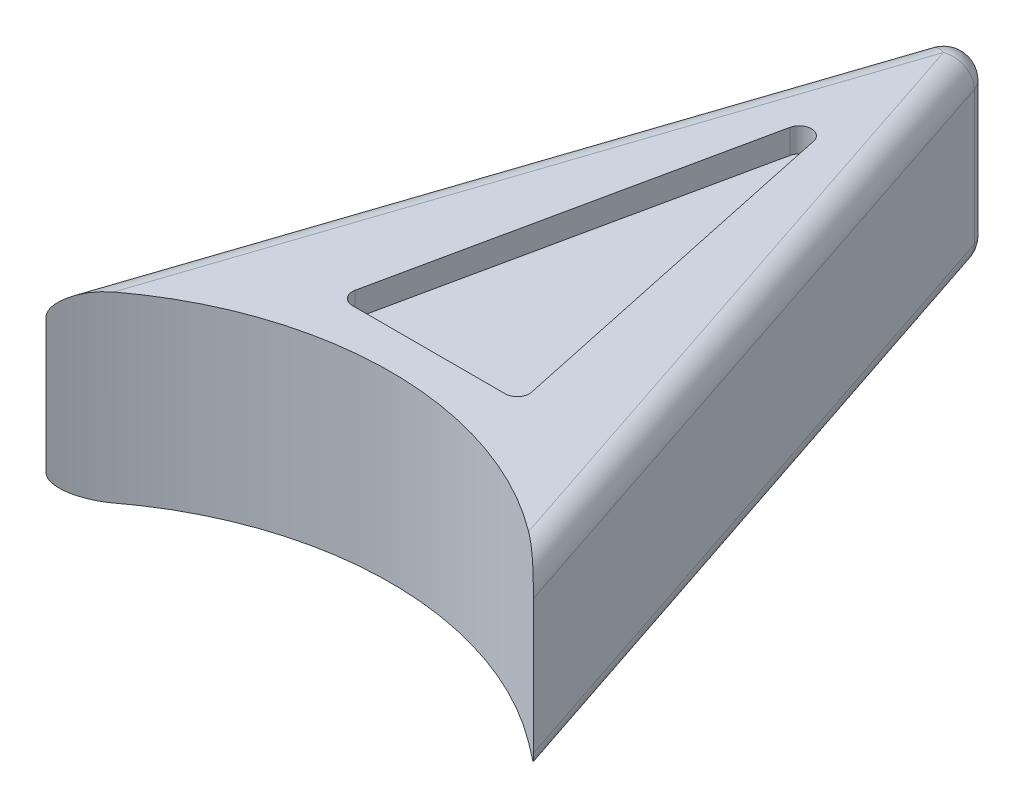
from build123d import *

# Parameters (mm, degrees)
BOSS_EXTRUDE1_DEPTH = 19.05
FILLET3_R           = 2.54
FILLET4_R           = 2.54
CUT_EXTRUDE1_DEPTH  = 2.54
FILLET5_R           = 1.27


with BuildPart() as part:
    # Sketch1 → Boss-Extrude1 (new body)
    with BuildSketch(Plane(origin=(0, 0, 0), x_dir=(1, 0, 0), z_dir=(0, 1, 0))):
        with BuildLine():
            Line((0, 76.2), (-25.4, 0))
            ThreePointArc((-25.4, 0), (0, 10.521024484), (25.4, 0))
            Line((25.4, 0), (0, 76.2))
        make_face()
    extrude(amount=BOSS_EXTRUDE1_DEPTH)

    # Fillet3
    fillet3_edges = [part.edges().sort_by_distance(p)[0] for p in [
        (0, 9.525, -76.2),
    ]]
    fillet(fillet3_edges, radius=FILLET3_R)

    # Fillet4
    fillet4_edges = [part.edges().sort_by_distance(p)[0] for p in [
        (-13.904827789, 0, -34.485516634),
        (-13.904827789, 19.05, -34.485516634),
        (0, 0, -70.707814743),
        (0, 19.05, -70.707814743),
        (13.904827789, 0, -34.485516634),
        (13.904827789, 19.05, -34.485516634),
    ]]
    fillet(fillet4_edges, radius=FILLET4_R)

    # Sketch2 → Cut-Extrude1 (cut)
    with BuildSketch(Plane(origin=(0, 19.05, 0), x_dir=(1, 0, 0), z_dir=(0, 1, 0))):
        Polygon((0, 59.214939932), (-9.525, 14.498133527), (9.525, 14.498133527), align=None)
    extrude(amount=-CUT_EXTRUDE1_DEPTH, mode=Mode.SUBTRACT)

    # Fillet5
    fillet5_edges = [part.edges().sort_by_distance(p)[0] for p in [
        (0, 17.78, -59.214939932),
        (9.525, 17.78, -14.498133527),
        (-9.525, 17.78, -14.498133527),
    ]]
    fillet(fillet5_edges, radius=FILLET5_R)


solid = part.part
